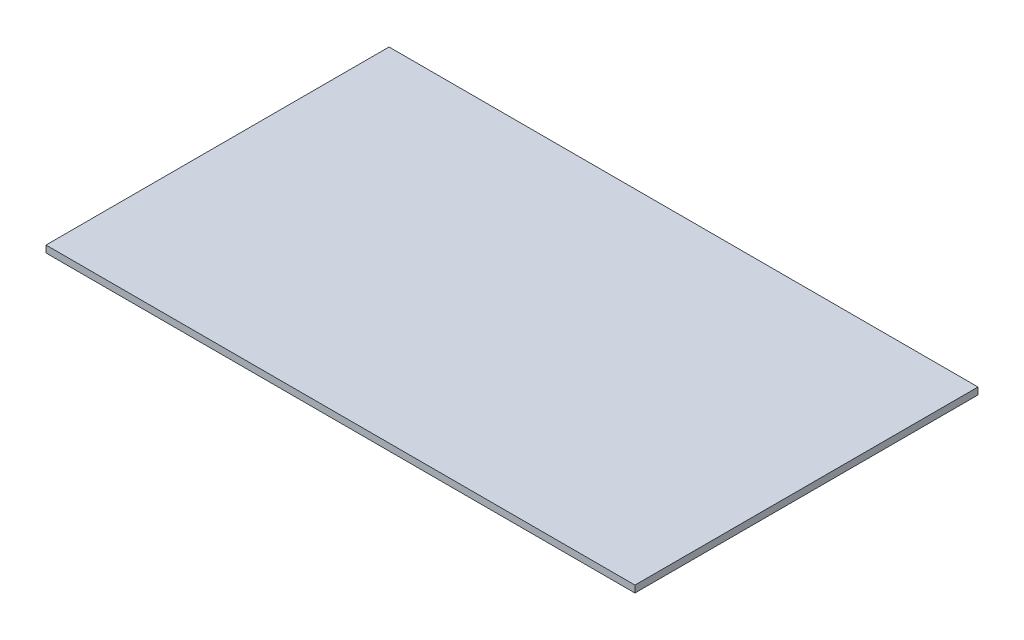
ISO-10303-21;
HEADER;
FILE_DESCRIPTION(('STEP AP214'),'2;1');
FILE_NAME('part.step','',(''),(''),'','','');
FILE_SCHEMA(('AUTOMOTIVE_DESIGN { 1 0 10303 214 1 1 1 1 }'));
ENDSEC;
DATA;
#1=APPLICATION_CONTEXT('core data for automotive mechanical design processes');
#2=APPLICATION_PROTOCOL_DEFINITION('international standard','automotive_design',2000,#1);
#3=PRODUCT_CONTEXT('',#1,'mechanical');
#4=PRODUCT('Part','Part','',(#3));
#5=PRODUCT_RELATED_PRODUCT_CATEGORY('part','',(#4));
#6=PRODUCT_DEFINITION_FORMATION('','',#4);
#7=PRODUCT_DEFINITION_CONTEXT('part definition',#1,'design');
#8=PRODUCT_DEFINITION('design','',#6,#7);
#9=PRODUCT_DEFINITION_SHAPE('','',#8);
#10=(LENGTH_UNIT() NAMED_UNIT(*) SI_UNIT(.MILLI.,.METRE.));
#11=(NAMED_UNIT(*) PLANE_ANGLE_UNIT() SI_UNIT($,.RADIAN.));
#12=(NAMED_UNIT(*) SI_UNIT($,.STERADIAN.) SOLID_ANGLE_UNIT());
#13=UNCERTAINTY_MEASURE_WITH_UNIT(LENGTH_MEASURE(1.E-05),#10,'distance_accuracy_value','');
#14=(GEOMETRIC_REPRESENTATION_CONTEXT(3) GLOBAL_UNCERTAINTY_ASSIGNED_CONTEXT((#13)) GLOBAL_UNIT_ASSIGNED_CONTEXT((#10,
#11,#12)) REPRESENTATION_CONTEXT('',''));
#15=CARTESIAN_POINT('',(0.,0.,0.));
#16=DIRECTION('',(0.,0.,1.));
#17=DIRECTION('',(1.,0.,0.));
#18=AXIS2_PLACEMENT_3D('',#15,#16,#17);
#19=CARTESIAN_POINT('',(0.,0.,149.));
#20=DIRECTION('',(1.,0.,0.));
#21=DIRECTION('',(0.,0.,-1.));
#22=AXIS2_PLACEMENT_3D('',#19,#20,#21);
#23=PLANE('',#22);
#24=DIRECTION('',(0.,-1.,0.));
#25=VECTOR('',#24,1.);
#26=CARTESIAN_POINT('',(0.,0.,0.));
#27=LINE('',#26,#25);
#28=CARTESIAN_POINT('',(0.,3.,0.));
#29=VERTEX_POINT('',#28);
#30=CARTESIAN_POINT('',(0.,0.,0.));
#31=VERTEX_POINT('',#30);
#32=EDGE_CURVE('E105',#29,#31,#27,.T.);
#33=ORIENTED_EDGE('',*,*,#32,.T.);
#34=DIRECTION('',(0.,0.,-1.));
#35=VECTOR('',#34,1.);
#36=CARTESIAN_POINT('',(0.,0.,149.));
#37=LINE('',#36,#35);
#38=CARTESIAN_POINT('',(0.,0.,149.));
#39=VERTEX_POINT('',#38);
#40=EDGE_CURVE('E11',#39,#31,#37,.T.);
#41=ORIENTED_EDGE('',*,*,#40,.F.);
#42=DIRECTION('',(0.,-1.,0.));
#43=VECTOR('',#42,1.);
#44=CARTESIAN_POINT('',(0.,0.,149.));
#45=LINE('',#44,#43);
#46=CARTESIAN_POINT('',(0.,3.,149.));
#47=VERTEX_POINT('',#46);
#48=EDGE_CURVE('E89',#47,#39,#45,.T.);
#49=ORIENTED_EDGE('',*,*,#48,.F.);
#50=DIRECTION('',(0.,0.,-1.));
#51=VECTOR('',#50,1.);
#52=CARTESIAN_POINT('',(0.,3.,149.));
#53=LINE('',#52,#51);
#54=EDGE_CURVE('E98',#47,#29,#53,.T.);
#55=ORIENTED_EDGE('',*,*,#54,.T.);
#56=EDGE_LOOP('',(#33,#41,#49,#55));
#57=FACE_BOUND('',#56,.T.);
#58=ADVANCED_FACE('F39',(#57),#23,.F.);
#59=CARTESIAN_POINT('',(0.,0.,149.));
#60=DIRECTION('',(0.,1.,0.));
#61=DIRECTION('',(0.,0.,1.));
#62=AXIS2_PLACEMENT_3D('',#59,#60,#61);
#63=PLANE('',#62);
#64=DIRECTION('',(1.,0.,0.));
#65=VECTOR('',#64,1.);
#66=CARTESIAN_POINT('',(0.,0.,0.));
#67=LINE('',#66,#65);
#68=CARTESIAN_POINT('',(255.8,0.,0.));
#69=VERTEX_POINT('',#68);
#70=EDGE_CURVE('E94',#31,#69,#67,.T.);
#71=ORIENTED_EDGE('',*,*,#70,.T.);
#72=DIRECTION('',(0.,0.,-1.));
#73=VECTOR('',#72,1.);
#74=CARTESIAN_POINT('',(255.8,0.,149.));
#75=LINE('',#74,#73);
#76=CARTESIAN_POINT('',(255.8,0.,149.));
#77=VERTEX_POINT('',#76);
#78=EDGE_CURVE('E50',#77,#69,#75,.T.);
#79=ORIENTED_EDGE('',*,*,#78,.F.);
#80=DIRECTION('',(1.,0.,0.));
#81=VECTOR('',#80,1.);
#82=CARTESIAN_POINT('',(0.,0.,149.));
#83=LINE('',#82,#81);
#84=EDGE_CURVE('E83',#39,#77,#83,.T.);
#85=ORIENTED_EDGE('',*,*,#84,.F.);
#86=ORIENTED_EDGE('',*,*,#40,.T.);
#87=EDGE_LOOP('',(#71,#79,#85,#86));
#88=FACE_BOUND('',#87,.T.);
#89=ADVANCED_FACE('F91',(#88),#63,.F.);
#90=CARTESIAN_POINT('',(255.8,0.,149.));
#91=DIRECTION('',(-1.,0.,0.));
#92=DIRECTION('',(0.,0.,1.));
#93=AXIS2_PLACEMENT_3D('',#90,#91,#92);
#94=PLANE('',#93);
#95=DIRECTION('',(0.,1.,0.));
#96=VECTOR('',#95,1.);
#97=CARTESIAN_POINT('',(255.8,0.,0.));
#98=LINE('',#97,#96);
#99=CARTESIAN_POINT('',(255.8,3.,0.));
#100=VERTEX_POINT('',#99);
#101=EDGE_CURVE('E75',#69,#100,#98,.T.);
#102=ORIENTED_EDGE('',*,*,#101,.T.);
#103=DIRECTION('',(0.,0.,-1.));
#104=VECTOR('',#103,1.);
#105=CARTESIAN_POINT('',(255.8,3.,149.));
#106=LINE('',#105,#104);
#107=CARTESIAN_POINT('',(255.8,3.,149.));
#108=VERTEX_POINT('',#107);
#109=EDGE_CURVE('E92',#108,#100,#106,.T.);
#110=ORIENTED_EDGE('',*,*,#109,.F.);
#111=DIRECTION('',(0.,1.,0.));
#112=VECTOR('',#111,1.);
#113=CARTESIAN_POINT('',(255.8,0.,149.));
#114=LINE('',#113,#112);
#115=EDGE_CURVE('E86',#77,#108,#114,.T.);
#116=ORIENTED_EDGE('',*,*,#115,.F.);
#117=ORIENTED_EDGE('',*,*,#78,.T.);
#118=EDGE_LOOP('',(#102,#110,#116,#117));
#119=FACE_BOUND('',#118,.T.);
#120=ADVANCED_FACE('F96',(#119),#94,.F.);
#121=CARTESIAN_POINT('',(0.,3.,149.));
#122=DIRECTION('',(0.,-1.,0.));
#123=DIRECTION('',(0.,0.,-1.));
#124=AXIS2_PLACEMENT_3D('',#121,#122,#123);
#125=PLANE('',#124);
#126=DIRECTION('',(-1.,0.,0.));
#127=VECTOR('',#126,1.);
#128=CARTESIAN_POINT('',(0.,3.,0.));
#129=LINE('',#128,#127);
#130=EDGE_CURVE('E77',#100,#29,#129,.T.);
#131=ORIENTED_EDGE('',*,*,#130,.T.);
#132=ORIENTED_EDGE('',*,*,#54,.F.);
#133=DIRECTION('',(-1.,0.,0.));
#134=VECTOR('',#133,1.);
#135=CARTESIAN_POINT('',(0.,3.,149.));
#136=LINE('',#135,#134);
#137=EDGE_CURVE('E54',#108,#47,#136,.T.);
#138=ORIENTED_EDGE('',*,*,#137,.F.);
#139=ORIENTED_EDGE('',*,*,#109,.T.);
#140=EDGE_LOOP('',(#131,#132,#138,#139));
#141=FACE_BOUND('',#140,.T.);
#142=ADVANCED_FACE('F108',(#141),#125,.F.);
#143=CARTESIAN_POINT('',(0.,0.,149.));
#144=DIRECTION('',(0.,0.,-1.));
#145=DIRECTION('',(-1.,0.,0.));
#146=AXIS2_PLACEMENT_3D('',#143,#144,#145);
#147=PLANE('',#146);
#148=ORIENTED_EDGE('',*,*,#48,.T.);
#149=ORIENTED_EDGE('',*,*,#84,.T.);
#150=ORIENTED_EDGE('',*,*,#115,.T.);
#151=ORIENTED_EDGE('',*,*,#137,.T.);
#152=EDGE_LOOP('',(#148,#149,#150,#151));
#153=FACE_BOUND('',#152,.T.);
#154=ADVANCED_FACE('F88',(#153),#147,.F.);
#155=CARTESIAN_POINT('',(0.,0.,0.));
#156=DIRECTION('',(0.,0.,-1.));
#157=DIRECTION('',(-1.,0.,0.));
#158=AXIS2_PLACEMENT_3D('',#155,#156,#157);
#159=PLANE('',#158);
#160=ORIENTED_EDGE('',*,*,#32,.F.);
#161=ORIENTED_EDGE('',*,*,#130,.F.);
#162=ORIENTED_EDGE('',*,*,#101,.F.);
#163=ORIENTED_EDGE('',*,*,#70,.F.);
#164=EDGE_LOOP('',(#160,#161,#162,#163));
#165=FACE_BOUND('',#164,.T.);
#166=ADVANCED_FACE('F115',(#165),#159,.T.);
#167=CLOSED_SHELL('',(#58,#89,#120,#142,#154,#166));
#168=MANIFOLD_SOLID_BREP('B2',#167);
#169=ADVANCED_BREP_SHAPE_REPRESENTATION('',(#18,#168),#14);
#170=SHAPE_DEFINITION_REPRESENTATION(#9,#169);
ENDSEC;
END-ISO-10303-21;
